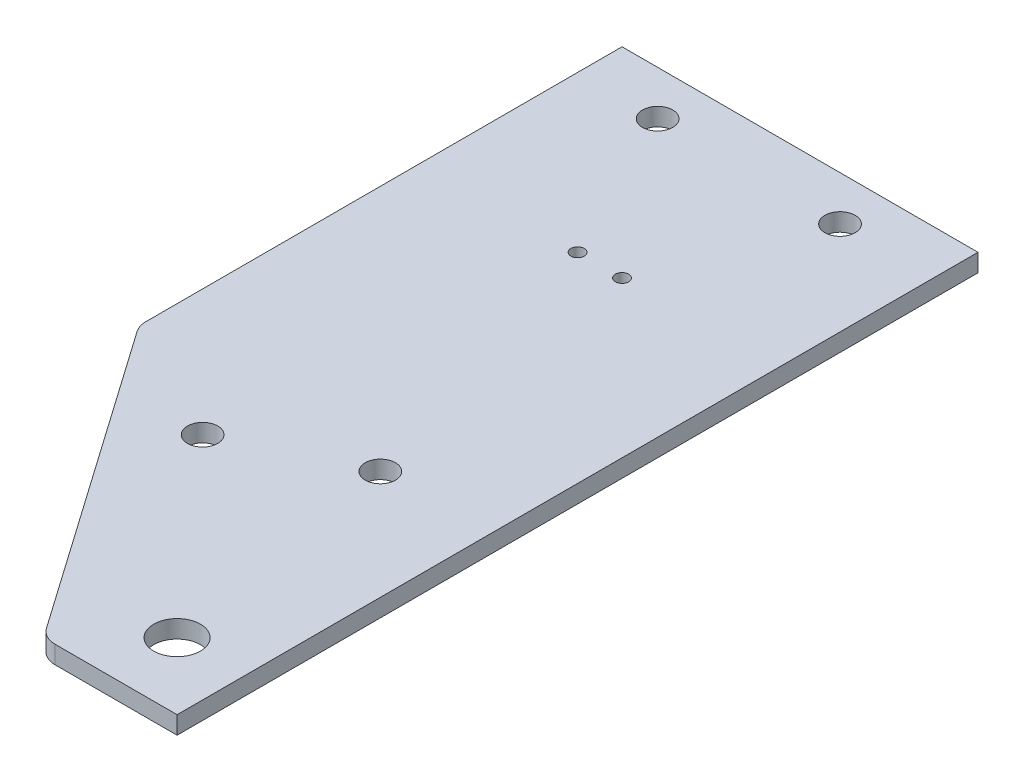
ISO-10303-21;
HEADER;
FILE_DESCRIPTION(('STEP AP214'),'2;1');
FILE_NAME('part.step','',(''),(''),'','','');
FILE_SCHEMA(('AUTOMOTIVE_DESIGN { 1 0 10303 214 1 1 1 1 }'));
ENDSEC;
DATA;
#1=APPLICATION_CONTEXT('core data for automotive mechanical design processes');
#2=APPLICATION_PROTOCOL_DEFINITION('international standard','automotive_design',2000,#1);
#3=PRODUCT_CONTEXT('',#1,'mechanical');
#4=PRODUCT('Part','Part','',(#3));
#5=PRODUCT_RELATED_PRODUCT_CATEGORY('part','',(#4));
#6=PRODUCT_DEFINITION_FORMATION('','',#4);
#7=PRODUCT_DEFINITION_CONTEXT('part definition',#1,'design');
#8=PRODUCT_DEFINITION('design','',#6,#7);
#9=PRODUCT_DEFINITION_SHAPE('','',#8);
#10=(LENGTH_UNIT() NAMED_UNIT(*) SI_UNIT(.MILLI.,.METRE.));
#11=(NAMED_UNIT(*) PLANE_ANGLE_UNIT() SI_UNIT($,.RADIAN.));
#12=(NAMED_UNIT(*) SI_UNIT($,.STERADIAN.) SOLID_ANGLE_UNIT());
#13=UNCERTAINTY_MEASURE_WITH_UNIT(LENGTH_MEASURE(1.E-05),#10,'distance_accuracy_value','');
#14=(GEOMETRIC_REPRESENTATION_CONTEXT(3) GLOBAL_UNCERTAINTY_ASSIGNED_CONTEXT((#13)) GLOBAL_UNIT_ASSIGNED_CONTEXT((#10,
#11,#12)) REPRESENTATION_CONTEXT('',''));
#15=CARTESIAN_POINT('',(0.,0.,0.));
#16=DIRECTION('',(0.,0.,1.));
#17=DIRECTION('',(1.,0.,0.));
#18=AXIS2_PLACEMENT_3D('',#15,#16,#17);
#19=CARTESIAN_POINT('',(0.,-4.,180.));
#20=DIRECTION('',(0.,1.,0.));
#21=DIRECTION('',(0.,0.,1.));
#22=AXIS2_PLACEMENT_3D('',#19,#20,#21);
#23=PLANE('',#22);
#24=CARTESIAN_POINT('',(35.,-4.,45.));
#25=DIRECTION('',(0.,1.,0.));
#26=DIRECTION('',(0.,0.,1.));
#27=AXIS2_PLACEMENT_3D('',#24,#25,#26);
#28=CIRCLE('',#27,1.5);
#29=CARTESIAN_POINT('',(35.,-4.,46.5));
#30=VERTEX_POINT('',#29);
#31=EDGE_CURVE('E226',#30,#30,#28,.T.);
#32=ORIENTED_EDGE('',*,*,#31,.T.);
#33=EDGE_LOOP('',(#32));
#34=FACE_BOUND('',#33,.T.);
#35=CARTESIAN_POINT('',(45.,-4.,45.));
#36=DIRECTION('',(0.,1.,0.));
#37=DIRECTION('',(0.,0.,1.));
#38=AXIS2_PLACEMENT_3D('',#35,#36,#37);
#39=CIRCLE('',#38,1.5);
#40=CARTESIAN_POINT('',(45.,-4.,46.5));
#41=VERTEX_POINT('',#40);
#42=EDGE_CURVE('E237',#41,#41,#39,.T.);
#43=ORIENTED_EDGE('',*,*,#42,.T.);
#44=EDGE_LOOP('',(#43));
#45=FACE_BOUND('',#44,.T.);
#46=CARTESIAN_POINT('',(59.,-3.99999,10.));
#47=DIRECTION('',(0.,1.,0.));
#48=DIRECTION('',(0.,0.,1.));
#49=AXIS2_PLACEMENT_3D('',#46,#47,#48);
#50=CIRCLE('',#49,3.4);
#51=CARTESIAN_POINT('',(59.,-3.99999,13.4));
#52=VERTEX_POINT('',#51);
#53=EDGE_CURVE('E240',#52,#52,#50,.T.);
#54=ORIENTED_EDGE('',*,*,#53,.T.);
#55=EDGE_LOOP('',(#54));
#56=FACE_BOUND('',#55,.T.);
#57=CARTESIAN_POINT('',(55.5,-3.99999,109.811686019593));
#58=DIRECTION('',(0.,1.,0.));
#59=DIRECTION('',(0.,0.,1.));
#60=AXIS2_PLACEMENT_3D('',#57,#58,#59);
#61=CIRCLE('',#60,3.4);
#62=CARTESIAN_POINT('',(55.5,-3.99999,113.211686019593));
#63=VERTEX_POINT('',#62);
#64=EDGE_CURVE('E246',#63,#63,#61,.T.);
#65=ORIENTED_EDGE('',*,*,#64,.T.);
#66=EDGE_LOOP('',(#65));
#67=FACE_BOUND('',#66,.T.);
#68=CARTESIAN_POINT('',(28.3783847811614,-3.99999,122.634243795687));
#69=DIRECTION('',(0.,1.,0.));
#70=DIRECTION('',(0.,0.,1.));
#71=AXIS2_PLACEMENT_3D('',#68,#69,#70);
#72=CIRCLE('',#71,3.4);
#73=CARTESIAN_POINT('',(28.3783847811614,-3.99999,126.034243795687));
#74=VERTEX_POINT('',#73);
#75=EDGE_CURVE('E252',#74,#74,#72,.T.);
#76=ORIENTED_EDGE('',*,*,#75,.T.);
#77=EDGE_LOOP('',(#76));
#78=FACE_BOUND('',#77,.T.);
#79=CARTESIAN_POINT('',(18.,-3.99999,9.99999999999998));
#80=DIRECTION('',(0.,1.,0.));
#81=DIRECTION('',(0.,0.,1.));
#82=AXIS2_PLACEMENT_3D('',#79,#80,#81);
#83=CIRCLE('',#82,3.4);
#84=CARTESIAN_POINT('',(18.,-3.99999,13.4));
#85=VERTEX_POINT('',#84);
#86=EDGE_CURVE('E258',#85,#85,#83,.T.);
#87=ORIENTED_EDGE('',*,*,#86,.T.);
#88=EDGE_LOOP('',(#87));
#89=FACE_BOUND('',#88,.T.);
#90=CARTESIAN_POINT('',(65.,-4.,165.));
#91=DIRECTION('',(0.,1.,0.));
#92=DIRECTION('',(0.,0.,1.));
#93=AXIS2_PLACEMENT_3D('',#90,#91,#92);
#94=CIRCLE('',#93,5.25);
#95=CARTESIAN_POINT('',(65.,-4.,170.25));
#96=VERTEX_POINT('',#95);
#97=EDGE_CURVE('E124',#96,#96,#94,.T.);
#98=ORIENTED_EDGE('',*,*,#97,.T.);
#99=EDGE_LOOP('',(#98));
#100=FACE_BOUND('',#99,.T.);
#101=DIRECTION('',(-0.573576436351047,0.,-0.819152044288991));
#102=VECTOR('',#101,1.);
#103=CARTESIAN_POINT('',(0.,-4.,108.592599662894));
#104=LINE('',#103,#102);
#105=CARTESIAN_POINT('',(48.5070750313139,-4.,177.867882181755));
#106=VERTEX_POINT('',#105);
#107=CARTESIAN_POINT('',(0.904239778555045,-4.,109.883987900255));
#108=VERTEX_POINT('',#107);
#109=EDGE_CURVE('E137',#106,#108,#104,.T.);
#110=ORIENTED_EDGE('',*,*,#109,.T.);
#111=CARTESIAN_POINT('',(5.,-4.,107.016105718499));
#112=DIRECTION('',(0.,1.,0.));
#113=DIRECTION('',(0.,0.,1.));
#114=AXIS2_PLACEMENT_3D('',#111,#112,#113);
#115=CIRCLE('',#114,5.);
#116=CARTESIAN_POINT('',(0.,-4.,107.016105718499));
#117=VERTEX_POINT('',#116);
#118=EDGE_CURVE('E42',#108,#117,#115,.F.);
#119=ORIENTED_EDGE('',*,*,#118,.T.);
#120=DIRECTION('',(0.,0.,-1.));
#121=VECTOR('',#120,1.);
#122=CARTESIAN_POINT('',(0.,-4.,180.));
#123=LINE('',#122,#121);
#124=CARTESIAN_POINT('',(0.,-4.,0.));
#125=VERTEX_POINT('',#124);
#126=EDGE_CURVE('E118',#117,#125,#123,.T.);
#127=ORIENTED_EDGE('',*,*,#126,.T.);
#128=DIRECTION('',(1.,0.,0.));
#129=VECTOR('',#128,1.);
#130=CARTESIAN_POINT('',(0.,-4.,0.));
#131=LINE('',#130,#129);
#132=CARTESIAN_POINT('',(80.,-4.,0.));
#133=VERTEX_POINT('',#132);
#134=EDGE_CURVE('E107',#125,#133,#131,.T.);
#135=ORIENTED_EDGE('',*,*,#134,.T.);
#136=DIRECTION('',(0.,0.,-1.));
#137=VECTOR('',#136,1.);
#138=CARTESIAN_POINT('',(80.,-4.,180.));
#139=LINE('',#138,#137);
#140=CARTESIAN_POINT('',(80.,-4.,180.));
#141=VERTEX_POINT('',#140);
#142=EDGE_CURVE('E105',#141,#133,#139,.T.);
#143=ORIENTED_EDGE('',*,*,#142,.F.);
#144=DIRECTION('',(1.,0.,0.));
#145=VECTOR('',#144,1.);
#146=CARTESIAN_POINT('',(0.,-4.,180.));
#147=LINE('',#146,#145);
#148=CARTESIAN_POINT('',(52.6028352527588,-4.,180.));
#149=VERTEX_POINT('',#148);
#150=EDGE_CURVE('E95',#149,#141,#147,.T.);
#151=ORIENTED_EDGE('',*,*,#150,.F.);
#152=CARTESIAN_POINT('',(52.6028352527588,-4.,175.));
#153=DIRECTION('',(0.,1.,0.));
#154=DIRECTION('',(0.,0.,1.));
#155=AXIS2_PLACEMENT_3D('',#152,#153,#154);
#156=CIRCLE('',#155,5.);
#157=EDGE_CURVE('E49',#149,#106,#156,.F.);
#158=ORIENTED_EDGE('',*,*,#157,.T.);
#159=EDGE_LOOP('',(#110,#119,#127,#135,#143,#151,#158));
#160=FACE_BOUND('',#159,.T.);
#161=ADVANCED_FACE('F34',(#34,#45,#56,#67,#78,#89,#100,#160),#23,.F.);
#162=CARTESIAN_POINT('',(80.,0.,180.));
#163=DIRECTION('',(1.,0.,0.));
#164=DIRECTION('',(0.,0.,-1.));
#165=AXIS2_PLACEMENT_3D('',#162,#163,#164);
#166=PLANE('',#165);
#167=DIRECTION('',(0.,-1.,0.));
#168=VECTOR('',#167,1.);
#169=CARTESIAN_POINT('',(80.,0.,0.));
#170=LINE('',#169,#168);
#171=CARTESIAN_POINT('',(80.,0.,0.));
#172=VERTEX_POINT('',#171);
#173=EDGE_CURVE('E123',#172,#133,#170,.T.);
#174=ORIENTED_EDGE('',*,*,#173,.F.);
#175=DIRECTION('',(0.,0.,-1.));
#176=VECTOR('',#175,1.);
#177=CARTESIAN_POINT('',(80.,0.,180.));
#178=LINE('',#177,#176);
#179=CARTESIAN_POINT('',(80.,0.,180.));
#180=VERTEX_POINT('',#179);
#181=EDGE_CURVE('E112',#180,#172,#178,.T.);
#182=ORIENTED_EDGE('',*,*,#181,.F.);
#183=DIRECTION('',(0.,-1.,0.));
#184=VECTOR('',#183,1.);
#185=CARTESIAN_POINT('',(80.,0.,180.));
#186=LINE('',#185,#184);
#187=EDGE_CURVE('E100',#180,#141,#186,.T.);
#188=ORIENTED_EDGE('',*,*,#187,.T.);
#189=ORIENTED_EDGE('',*,*,#142,.T.);
#190=EDGE_LOOP('',(#174,#182,#188,#189));
#191=FACE_BOUND('',#190,.T.);
#192=ADVANCED_FACE('F115',(#191),#166,.T.);
#193=CARTESIAN_POINT('',(0.,0.,180.));
#194=DIRECTION('',(0.,1.,0.));
#195=DIRECTION('',(0.,0.,1.));
#196=AXIS2_PLACEMENT_3D('',#193,#194,#195);
#197=PLANE('',#196);
#198=CARTESIAN_POINT('',(35.,0.,45.));
#199=DIRECTION('',(0.,1.,0.));
#200=DIRECTION('',(0.,0.,1.));
#201=AXIS2_PLACEMENT_3D('',#198,#199,#200);
#202=CIRCLE('',#201,1.49999999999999);
#203=CARTESIAN_POINT('',(35.,0.,46.5));
#204=VERTEX_POINT('',#203);
#205=EDGE_CURVE('E229',#204,#204,#202,.T.);
#206=ORIENTED_EDGE('',*,*,#205,.F.);
#207=EDGE_LOOP('',(#206));
#208=FACE_BOUND('',#207,.T.);
#209=CARTESIAN_POINT('',(45.,0.,45.));
#210=DIRECTION('',(0.,1.,0.));
#211=DIRECTION('',(0.,0.,1.));
#212=AXIS2_PLACEMENT_3D('',#209,#210,#211);
#213=CIRCLE('',#212,1.49999999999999);
#214=CARTESIAN_POINT('',(45.,0.,46.5));
#215=VERTEX_POINT('',#214);
#216=EDGE_CURVE('E232',#215,#215,#213,.T.);
#217=ORIENTED_EDGE('',*,*,#216,.F.);
#218=EDGE_LOOP('',(#217));
#219=FACE_BOUND('',#218,.T.);
#220=CARTESIAN_POINT('',(59.,0.,10.));
#221=DIRECTION('',(0.,1.,0.));
#222=DIRECTION('',(0.,0.,1.));
#223=AXIS2_PLACEMENT_3D('',#220,#221,#222);
#224=CIRCLE('',#223,3.4);
#225=CARTESIAN_POINT('',(59.,0.,13.4));
#226=VERTEX_POINT('',#225);
#227=EDGE_CURVE('E243',#226,#226,#224,.T.);
#228=ORIENTED_EDGE('',*,*,#227,.F.);
#229=EDGE_LOOP('',(#228));
#230=FACE_BOUND('',#229,.T.);
#231=CARTESIAN_POINT('',(55.5,0.,109.811686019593));
#232=DIRECTION('',(0.,1.,0.));
#233=DIRECTION('',(0.,0.,1.));
#234=AXIS2_PLACEMENT_3D('',#231,#232,#233);
#235=CIRCLE('',#234,3.4);
#236=CARTESIAN_POINT('',(55.5,0.,113.211686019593));
#237=VERTEX_POINT('',#236);
#238=EDGE_CURVE('E249',#237,#237,#235,.T.);
#239=ORIENTED_EDGE('',*,*,#238,.F.);
#240=EDGE_LOOP('',(#239));
#241=FACE_BOUND('',#240,.T.);
#242=CARTESIAN_POINT('',(28.3783847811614,0.,122.634243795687));
#243=DIRECTION('',(0.,1.,0.));
#244=DIRECTION('',(0.,0.,1.));
#245=AXIS2_PLACEMENT_3D('',#242,#243,#244);
#246=CIRCLE('',#245,3.4);
#247=CARTESIAN_POINT('',(28.3783847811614,0.,126.034243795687));
#248=VERTEX_POINT('',#247);
#249=EDGE_CURVE('E255',#248,#248,#246,.T.);
#250=ORIENTED_EDGE('',*,*,#249,.F.);
#251=EDGE_LOOP('',(#250));
#252=FACE_BOUND('',#251,.T.);
#253=CARTESIAN_POINT('',(18.,0.,9.99999999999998));
#254=DIRECTION('',(0.,1.,0.));
#255=DIRECTION('',(0.,0.,1.));
#256=AXIS2_PLACEMENT_3D('',#253,#254,#255);
#257=CIRCLE('',#256,3.4);
#258=CARTESIAN_POINT('',(18.,0.,13.4));
#259=VERTEX_POINT('',#258);
#260=EDGE_CURVE('E261',#259,#259,#257,.T.);
#261=ORIENTED_EDGE('',*,*,#260,.F.);
#262=EDGE_LOOP('',(#261));
#263=FACE_BOUND('',#262,.T.);
#264=CARTESIAN_POINT('',(65.,0.,165.));
#265=DIRECTION('',(0.,1.,0.));
#266=DIRECTION('',(0.,0.,1.));
#267=AXIS2_PLACEMENT_3D('',#264,#265,#266);
#268=CIRCLE('',#267,5.25);
#269=CARTESIAN_POINT('',(65.,0.,170.25));
#270=VERTEX_POINT('',#269);
#271=EDGE_CURVE('E264',#270,#270,#268,.T.);
#272=ORIENTED_EDGE('',*,*,#271,.F.);
#273=EDGE_LOOP('',(#272));
#274=FACE_BOUND('',#273,.T.);
#275=DIRECTION('',(0.,0.,-1.));
#276=VECTOR('',#275,1.);
#277=CARTESIAN_POINT('',(0.,0.,180.));
#278=LINE('',#277,#276);
#279=CARTESIAN_POINT('',(0.,0.,107.016105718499));
#280=VERTEX_POINT('',#279);
#281=CARTESIAN_POINT('',(0.,0.,0.));
#282=VERTEX_POINT('',#281);
#283=EDGE_CURVE('E132',#280,#282,#278,.T.);
#284=ORIENTED_EDGE('',*,*,#283,.F.);
#285=CARTESIAN_POINT('',(5.,0.,107.016105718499));
#286=DIRECTION('',(0.,1.,0.));
#287=DIRECTION('',(0.,0.,1.));
#288=AXIS2_PLACEMENT_3D('',#285,#286,#287);
#289=CIRCLE('',#288,5.);
#290=CARTESIAN_POINT('',(0.904239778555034,0.,109.883987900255));
#291=VERTEX_POINT('',#290);
#292=EDGE_CURVE('E144',#280,#291,#289,.T.);
#293=ORIENTED_EDGE('',*,*,#292,.T.);
#294=DIRECTION('',(0.573576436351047,0.,0.819152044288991));
#295=VECTOR('',#294,1.);
#296=CARTESIAN_POINT('',(33.5505035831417,0.,156.507684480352));
#297=LINE('',#296,#295);
#298=CARTESIAN_POINT('',(48.5070750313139,0.,177.867882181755));
#299=VERTEX_POINT('',#298);
#300=EDGE_CURVE('E111',#291,#299,#297,.T.);
#301=ORIENTED_EDGE('',*,*,#300,.T.);
#302=CARTESIAN_POINT('',(52.6028352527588,0.,175.));
#303=DIRECTION('',(0.,1.,0.));
#304=DIRECTION('',(0.,0.,1.));
#305=AXIS2_PLACEMENT_3D('',#302,#303,#304);
#306=CIRCLE('',#305,5.);
#307=CARTESIAN_POINT('',(52.6028352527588,0.,180.));
#308=VERTEX_POINT('',#307);
#309=EDGE_CURVE('E142',#299,#308,#306,.T.);
#310=ORIENTED_EDGE('',*,*,#309,.T.);
#311=DIRECTION('',(1.,0.,0.));
#312=VECTOR('',#311,1.);
#313=CARTESIAN_POINT('',(0.,0.,180.));
#314=LINE('',#313,#312);
#315=EDGE_CURVE('E116',#308,#180,#314,.T.);
#316=ORIENTED_EDGE('',*,*,#315,.T.);
#317=ORIENTED_EDGE('',*,*,#181,.T.);
#318=DIRECTION('',(1.,0.,0.));
#319=VECTOR('',#318,1.);
#320=CARTESIAN_POINT('',(0.,0.,0.));
#321=LINE('',#320,#319);
#322=EDGE_CURVE('E126',#282,#172,#321,.T.);
#323=ORIENTED_EDGE('',*,*,#322,.F.);
#324=EDGE_LOOP('',(#284,#293,#301,#310,#316,#317,#323));
#325=FACE_BOUND('',#324,.T.);
#326=ADVANCED_FACE('F159',(#208,#219,#230,#241,#252,#263,#274,#325),#197,.T.);
#327=CARTESIAN_POINT('',(0.,-4.,180.));
#328=DIRECTION('',(-1.,0.,0.));
#329=DIRECTION('',(0.,0.,1.));
#330=AXIS2_PLACEMENT_3D('',#327,#328,#329);
#331=PLANE('',#330);
#332=ORIENTED_EDGE('',*,*,#126,.F.);
#333=DIRECTION('',(0.,1.,0.));
#334=VECTOR('',#333,1.);
#335=CARTESIAN_POINT('',(0.,-4.,107.016105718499));
#336=LINE('',#335,#334);
#337=EDGE_CURVE('E139',#117,#280,#336,.T.);
#338=ORIENTED_EDGE('',*,*,#337,.T.);
#339=ORIENTED_EDGE('',*,*,#283,.T.);
#340=DIRECTION('',(0.,1.,0.));
#341=VECTOR('',#340,1.);
#342=CARTESIAN_POINT('',(0.,-4.,0.));
#343=LINE('',#342,#341);
#344=EDGE_CURVE('E102',#125,#282,#343,.T.);
#345=ORIENTED_EDGE('',*,*,#344,.F.);
#346=EDGE_LOOP('',(#332,#338,#339,#345));
#347=FACE_BOUND('',#346,.T.);
#348=ADVANCED_FACE('F155',(#347),#331,.T.);
#349=CARTESIAN_POINT('',(80.,-4.,180.));
#350=DIRECTION('',(0.,0.,-1.));
#351=DIRECTION('',(-1.,0.,0.));
#352=AXIS2_PLACEMENT_3D('',#349,#350,#351);
#353=PLANE('',#352);
#354=ORIENTED_EDGE('',*,*,#315,.F.);
#355=DIRECTION('',(0.,-1.,0.));
#356=VECTOR('',#355,1.);
#357=CARTESIAN_POINT('',(52.6028352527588,-4.,180.));
#358=LINE('',#357,#356);
#359=EDGE_CURVE('E11',#308,#149,#358,.T.);
#360=ORIENTED_EDGE('',*,*,#359,.T.);
#361=ORIENTED_EDGE('',*,*,#150,.T.);
#362=ORIENTED_EDGE('',*,*,#187,.F.);
#363=EDGE_LOOP('',(#354,#360,#361,#362));
#364=FACE_BOUND('',#363,.T.);
#365=ADVANCED_FACE('F98',(#364),#353,.F.);
#366=CARTESIAN_POINT('',(80.,-4.,0.));
#367=DIRECTION('',(0.,0.,-1.));
#368=DIRECTION('',(-1.,0.,0.));
#369=AXIS2_PLACEMENT_3D('',#366,#367,#368);
#370=PLANE('',#369);
#371=ORIENTED_EDGE('',*,*,#134,.F.);
#372=ORIENTED_EDGE('',*,*,#344,.T.);
#373=ORIENTED_EDGE('',*,*,#322,.T.);
#374=ORIENTED_EDGE('',*,*,#173,.T.);
#375=EDGE_LOOP('',(#371,#372,#373,#374));
#376=FACE_BOUND('',#375,.T.);
#377=ADVANCED_FACE('F164',(#376),#370,.T.);
#378=CARTESIAN_POINT('',(0.,-4.,108.592599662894));
#379=DIRECTION('',(-0.819152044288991,0.,0.573576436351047));
#380=DIRECTION('',(0.573576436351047,0.,0.819152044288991));
#381=AXIS2_PLACEMENT_3D('',#378,#379,#380);
#382=PLANE('',#381);
#383=ORIENTED_EDGE('',*,*,#300,.F.);
#384=DIRECTION('',(0.,1.,0.));
#385=VECTOR('',#384,1.);
#386=CARTESIAN_POINT('',(0.904239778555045,-4.,109.883987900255));
#387=LINE('',#386,#385);
#388=EDGE_CURVE('E56',#291,#108,#387,.F.);
#389=ORIENTED_EDGE('',*,*,#388,.T.);
#390=ORIENTED_EDGE('',*,*,#109,.F.);
#391=DIRECTION('',(0.,-1.,0.));
#392=VECTOR('',#391,1.);
#393=CARTESIAN_POINT('',(48.5070750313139,0.,177.867882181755));
#394=LINE('',#393,#392);
#395=EDGE_CURVE('E146',#106,#299,#394,.F.);
#396=ORIENTED_EDGE('',*,*,#395,.T.);
#397=EDGE_LOOP('',(#383,#389,#390,#396));
#398=FACE_BOUND('',#397,.T.);
#399=ADVANCED_FACE('F162',(#398),#382,.T.);
#400=CARTESIAN_POINT('',(5.,-4.,107.016105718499));
#401=DIRECTION('',(0.,1.,0.));
#402=DIRECTION('',(0.,0.,1.));
#403=AXIS2_PLACEMENT_3D('',#400,#401,#402);
#404=CYLINDRICAL_SURFACE('',#403,5.);
#405=ORIENTED_EDGE('',*,*,#118,.F.);
#406=ORIENTED_EDGE('',*,*,#388,.F.);
#407=ORIENTED_EDGE('',*,*,#292,.F.);
#408=ORIENTED_EDGE('',*,*,#337,.F.);
#409=EDGE_LOOP('',(#405,#406,#407,#408));
#410=FACE_BOUND('',#409,.T.);
#411=ADVANCED_FACE('F157',(#410),#404,.T.);
#412=CARTESIAN_POINT('',(52.6028352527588,-4.,175.));
#413=DIRECTION('',(0.,1.,0.));
#414=DIRECTION('',(0.,0.,1.));
#415=AXIS2_PLACEMENT_3D('',#412,#413,#414);
#416=CYLINDRICAL_SURFACE('',#415,5.);
#417=ORIENTED_EDGE('',*,*,#309,.F.);
#418=ORIENTED_EDGE('',*,*,#395,.F.);
#419=ORIENTED_EDGE('',*,*,#157,.F.);
#420=ORIENTED_EDGE('',*,*,#359,.F.);
#421=EDGE_LOOP('',(#417,#418,#419,#420));
#422=FACE_BOUND('',#421,.T.);
#423=ADVANCED_FACE('F36',(#422),#416,.T.);
#424=CARTESIAN_POINT('',(65.,-4.,165.));
#425=DIRECTION('',(0.,1.,0.));
#426=DIRECTION('',(0.,0.,1.));
#427=AXIS2_PLACEMENT_3D('',#424,#425,#426);
#428=CYLINDRICAL_SURFACE('',#427,5.25);
#429=ORIENTED_EDGE('',*,*,#97,.F.);
#430=EDGE_LOOP('',(#429));
#431=FACE_BOUND('',#430,.T.);
#432=ORIENTED_EDGE('',*,*,#271,.T.);
#433=EDGE_LOOP('',(#432));
#434=FACE_BOUND('',#433,.T.);
#435=ADVANCED_FACE('F188',(#431,#434),#428,.F.);
#436=CARTESIAN_POINT('',(18.,0.,9.99999999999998));
#437=DIRECTION('',(0.,1.,0.));
#438=DIRECTION('',(0.,0.,1.));
#439=AXIS2_PLACEMENT_3D('',#436,#437,#438);
#440=CYLINDRICAL_SURFACE('',#439,3.4);
#441=ORIENTED_EDGE('',*,*,#86,.F.);
#442=EDGE_LOOP('',(#441));
#443=FACE_BOUND('',#442,.T.);
#444=ORIENTED_EDGE('',*,*,#260,.T.);
#445=EDGE_LOOP('',(#444));
#446=FACE_BOUND('',#445,.T.);
#447=ADVANCED_FACE('F192',(#443,#446),#440,.F.);
#448=CARTESIAN_POINT('',(28.3783847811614,0.,122.634243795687));
#449=DIRECTION('',(0.,1.,0.));
#450=DIRECTION('',(0.,0.,1.));
#451=AXIS2_PLACEMENT_3D('',#448,#449,#450);
#452=CYLINDRICAL_SURFACE('',#451,3.4);
#453=ORIENTED_EDGE('',*,*,#75,.F.);
#454=EDGE_LOOP('',(#453));
#455=FACE_BOUND('',#454,.T.);
#456=ORIENTED_EDGE('',*,*,#249,.T.);
#457=EDGE_LOOP('',(#456));
#458=FACE_BOUND('',#457,.T.);
#459=ADVANCED_FACE('F198',(#455,#458),#452,.F.);
#460=CARTESIAN_POINT('',(55.5,0.,109.811686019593));
#461=DIRECTION('',(0.,1.,0.));
#462=DIRECTION('',(0.,0.,1.));
#463=AXIS2_PLACEMENT_3D('',#460,#461,#462);
#464=CYLINDRICAL_SURFACE('',#463,3.4);
#465=ORIENTED_EDGE('',*,*,#64,.F.);
#466=EDGE_LOOP('',(#465));
#467=FACE_BOUND('',#466,.T.);
#468=ORIENTED_EDGE('',*,*,#238,.T.);
#469=EDGE_LOOP('',(#468));
#470=FACE_BOUND('',#469,.T.);
#471=ADVANCED_FACE('F206',(#467,#470),#464,.F.);
#472=CARTESIAN_POINT('',(59.,0.,10.));
#473=DIRECTION('',(0.,1.,0.));
#474=DIRECTION('',(0.,0.,1.));
#475=AXIS2_PLACEMENT_3D('',#472,#473,#474);
#476=CYLINDRICAL_SURFACE('',#475,3.4);
#477=ORIENTED_EDGE('',*,*,#53,.F.);
#478=EDGE_LOOP('',(#477));
#479=FACE_BOUND('',#478,.T.);
#480=ORIENTED_EDGE('',*,*,#227,.T.);
#481=EDGE_LOOP('',(#480));
#482=FACE_BOUND('',#481,.T.);
#483=ADVANCED_FACE('F210',(#479,#482),#476,.F.);
#484=CARTESIAN_POINT('',(45.,0.,45.));
#485=DIRECTION('',(0.,1.,0.));
#486=DIRECTION('',(0.,0.,1.));
#487=AXIS2_PLACEMENT_3D('',#484,#485,#486);
#488=CYLINDRICAL_SURFACE('',#487,1.49999999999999);
#489=ORIENTED_EDGE('',*,*,#42,.F.);
#490=EDGE_LOOP('',(#489));
#491=FACE_BOUND('',#490,.T.);
#492=ORIENTED_EDGE('',*,*,#216,.T.);
#493=EDGE_LOOP('',(#492));
#494=FACE_BOUND('',#493,.T.);
#495=ADVANCED_FACE('F214',(#491,#494),#488,.F.);
#496=CARTESIAN_POINT('',(35.,0.,45.));
#497=DIRECTION('',(0.,1.,0.));
#498=DIRECTION('',(0.,0.,1.));
#499=AXIS2_PLACEMENT_3D('',#496,#497,#498);
#500=CYLINDRICAL_SURFACE('',#499,1.49999999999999);
#501=ORIENTED_EDGE('',*,*,#31,.F.);
#502=EDGE_LOOP('',(#501));
#503=FACE_BOUND('',#502,.T.);
#504=ORIENTED_EDGE('',*,*,#205,.T.);
#505=EDGE_LOOP('',(#504));
#506=FACE_BOUND('',#505,.T.);
#507=ADVANCED_FACE('F218',(#503,#506),#500,.F.);
#508=CLOSED_SHELL('',(#161,#192,#326,#348,#365,#377,#399,#411,#423,#435,#447,#459,#471,#483,
#495,#507));
#509=MANIFOLD_SOLID_BREP('B2',#508);
#510=ADVANCED_BREP_SHAPE_REPRESENTATION('',(#18,#509),#14);
#511=SHAPE_DEFINITION_REPRESENTATION(#9,#510);
ENDSEC;
END-ISO-10303-21;
